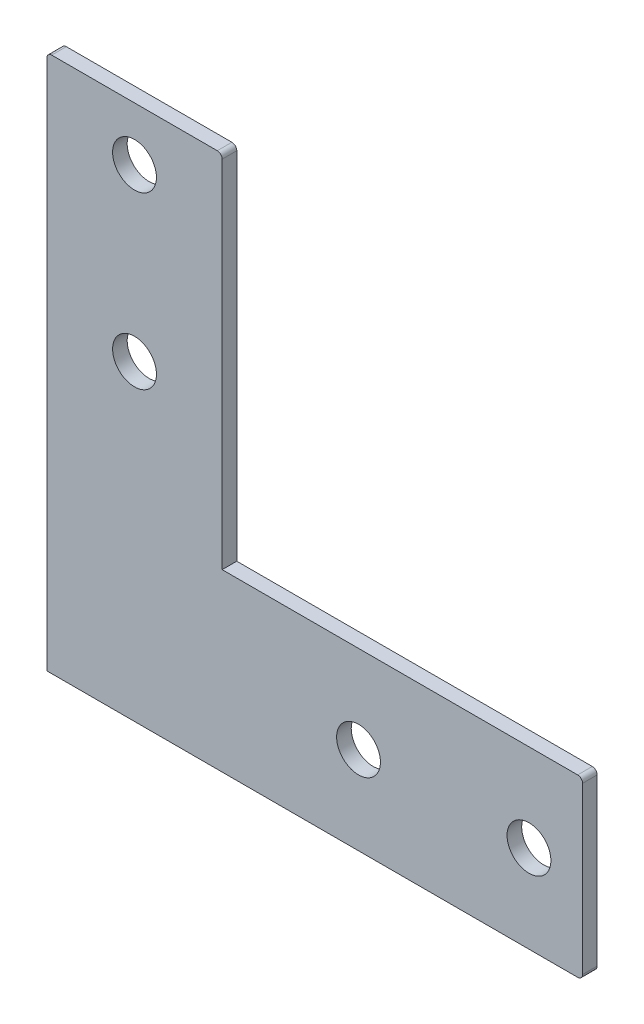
ISO-10303-21;
HEADER;
FILE_DESCRIPTION(('STEP AP214'),'2;1');
FILE_NAME('part.step','',(''),(''),'','','');
FILE_SCHEMA(('AUTOMOTIVE_DESIGN { 1 0 10303 214 1 1 1 1 }'));
ENDSEC;
DATA;
#1=APPLICATION_CONTEXT('core data for automotive mechanical design processes');
#2=APPLICATION_PROTOCOL_DEFINITION('international standard','automotive_design',2000,#1);
#3=PRODUCT_CONTEXT('',#1,'mechanical');
#4=PRODUCT('Part','Part','',(#3));
#5=PRODUCT_RELATED_PRODUCT_CATEGORY('part','',(#4));
#6=PRODUCT_DEFINITION_FORMATION('','',#4);
#7=PRODUCT_DEFINITION_CONTEXT('part definition',#1,'design');
#8=PRODUCT_DEFINITION('design','',#6,#7);
#9=PRODUCT_DEFINITION_SHAPE('','',#8);
#10=(LENGTH_UNIT() NAMED_UNIT(*) SI_UNIT(.MILLI.,.METRE.));
#11=(NAMED_UNIT(*) PLANE_ANGLE_UNIT() SI_UNIT($,.RADIAN.));
#12=(NAMED_UNIT(*) SI_UNIT($,.STERADIAN.) SOLID_ANGLE_UNIT());
#13=UNCERTAINTY_MEASURE_WITH_UNIT(LENGTH_MEASURE(1.E-05),#10,'distance_accuracy_value','');
#14=(GEOMETRIC_REPRESENTATION_CONTEXT(3) GLOBAL_UNCERTAINTY_ASSIGNED_CONTEXT((#13)) GLOBAL_UNIT_ASSIGNED_CONTEXT((#10,
#11,#12)) REPRESENTATION_CONTEXT('',''));
#15=CARTESIAN_POINT('',(0.,0.,0.));
#16=DIRECTION('',(0.,0.,1.));
#17=DIRECTION('',(1.,0.,0.));
#18=AXIS2_PLACEMENT_3D('',#15,#16,#17);
#19=CARTESIAN_POINT('',(0.,0.,1.5));
#20=DIRECTION('',(0.,0.,-1.));
#21=DIRECTION('',(-1.,0.,0.));
#22=AXIS2_PLACEMENT_3D('',#19,#20,#21);
#23=PLANE('',#22);
#24=CARTESIAN_POINT('',(99.,18.,1.5));
#25=DIRECTION('',(0.,0.,1.));
#26=DIRECTION('',(-1.,0.,0.));
#27=AXIS2_PLACEMENT_3D('',#24,#25,#26);
#28=CIRCLE('',#27,4.50000000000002);
#29=CARTESIAN_POINT('',(94.5,18.,1.5));
#30=VERTEX_POINT('',#29);
#31=EDGE_CURVE('E229',#30,#30,#28,.T.);
#32=ORIENTED_EDGE('',*,*,#31,.F.);
#33=EDGE_LOOP('',(#32));
#34=FACE_BOUND('',#33,.T.);
#35=CARTESIAN_POINT('',(18.,99.,1.5));
#36=DIRECTION('',(0.,0.,1.));
#37=DIRECTION('',(1.,0.,0.));
#38=AXIS2_PLACEMENT_3D('',#35,#36,#37);
#39=CIRCLE('',#38,4.50000000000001);
#40=CARTESIAN_POINT('',(22.5,99.,1.5));
#41=VERTEX_POINT('',#40);
#42=EDGE_CURVE('E149',#41,#41,#39,.T.);
#43=ORIENTED_EDGE('',*,*,#42,.F.);
#44=EDGE_LOOP('',(#43));
#45=FACE_BOUND('',#44,.T.);
#46=DIRECTION('',(1.,0.,0.));
#47=VECTOR('',#46,1.);
#48=CARTESIAN_POINT('',(110.,0.,1.5));
#49=LINE('',#48,#47);
#50=CARTESIAN_POINT('',(0.,0.,1.5));
#51=VERTEX_POINT('',#50);
#52=CARTESIAN_POINT('',(109.,0.,1.5));
#53=VERTEX_POINT('',#52);
#54=EDGE_CURVE('E159',#51,#53,#49,.T.);
#55=ORIENTED_EDGE('',*,*,#54,.T.);
#56=CARTESIAN_POINT('',(109.,1.00000000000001,1.5));
#57=DIRECTION('',(0.,0.,-1.));
#58=DIRECTION('',(-1.,0.,0.));
#59=AXIS2_PLACEMENT_3D('',#56,#57,#58);
#60=CIRCLE('',#59,1.);
#61=CARTESIAN_POINT('',(110.,1.00000000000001,1.5));
#62=VERTEX_POINT('',#61);
#63=EDGE_CURVE('E180',#53,#62,#60,.F.);
#64=ORIENTED_EDGE('',*,*,#63,.T.);
#65=DIRECTION('',(0.,1.,0.));
#66=VECTOR('',#65,1.);
#67=CARTESIAN_POINT('',(110.,36.,1.5));
#68=LINE('',#67,#66);
#69=CARTESIAN_POINT('',(110.,35.,1.5));
#70=VERTEX_POINT('',#69);
#71=EDGE_CURVE('E123',#62,#70,#68,.T.);
#72=ORIENTED_EDGE('',*,*,#71,.T.);
#73=CARTESIAN_POINT('',(109.,35.,1.5));
#74=DIRECTION('',(0.,0.,-1.));
#75=DIRECTION('',(-1.,0.,0.));
#76=AXIS2_PLACEMENT_3D('',#73,#74,#75);
#77=CIRCLE('',#76,1.);
#78=CARTESIAN_POINT('',(109.,36.,1.5));
#79=VERTEX_POINT('',#78);
#80=EDGE_CURVE('E119',#70,#79,#77,.F.);
#81=ORIENTED_EDGE('',*,*,#80,.T.);
#82=DIRECTION('',(-1.,0.,0.));
#83=VECTOR('',#82,1.);
#84=CARTESIAN_POINT('',(36.,36.,1.5));
#85=LINE('',#84,#83);
#86=CARTESIAN_POINT('',(36.,36.,1.5));
#87=VERTEX_POINT('',#86);
#88=EDGE_CURVE('E110',#79,#87,#85,.T.);
#89=ORIENTED_EDGE('',*,*,#88,.T.);
#90=DIRECTION('',(0.,1.,0.));
#91=VECTOR('',#90,1.);
#92=CARTESIAN_POINT('',(36.,110.,1.5));
#93=LINE('',#92,#91);
#94=CARTESIAN_POINT('',(36.,109.,1.5));
#95=VERTEX_POINT('',#94);
#96=EDGE_CURVE('E115',#87,#95,#93,.T.);
#97=ORIENTED_EDGE('',*,*,#96,.T.);
#98=CARTESIAN_POINT('',(35.,109.,1.5));
#99=DIRECTION('',(0.,0.,-1.));
#100=DIRECTION('',(-1.,0.,0.));
#101=AXIS2_PLACEMENT_3D('',#98,#99,#100);
#102=CIRCLE('',#101,1.);
#103=CARTESIAN_POINT('',(35.,110.,1.5));
#104=VERTEX_POINT('',#103);
#105=EDGE_CURVE('E176',#95,#104,#102,.F.);
#106=ORIENTED_EDGE('',*,*,#105,.T.);
#107=DIRECTION('',(-1.,0.,0.));
#108=VECTOR('',#107,1.);
#109=CARTESIAN_POINT('',(0.,110.,1.5));
#110=LINE('',#109,#108);
#111=CARTESIAN_POINT('',(1.,110.,1.5));
#112=VERTEX_POINT('',#111);
#113=EDGE_CURVE('E138',#104,#112,#110,.T.);
#114=ORIENTED_EDGE('',*,*,#113,.T.);
#115=CARTESIAN_POINT('',(1.,109.,1.5));
#116=DIRECTION('',(0.,0.,-1.));
#117=DIRECTION('',(-1.,0.,0.));
#118=AXIS2_PLACEMENT_3D('',#115,#116,#117);
#119=CIRCLE('',#118,1.);
#120=CARTESIAN_POINT('',(0.,109.,1.5));
#121=VERTEX_POINT('',#120);
#122=EDGE_CURVE('E49',#112,#121,#119,.F.);
#123=ORIENTED_EDGE('',*,*,#122,.T.);
#124=DIRECTION('',(0.,-1.,0.));
#125=VECTOR('',#124,1.);
#126=CARTESIAN_POINT('',(0.,0.,1.5));
#127=LINE('',#126,#125);
#128=EDGE_CURVE('E140',#121,#51,#127,.T.);
#129=ORIENTED_EDGE('',*,*,#128,.T.);
#130=EDGE_LOOP('',(#55,#64,#72,#81,#89,#97,#106,#114,#123,#129));
#131=FACE_BOUND('',#130,.T.);
#132=CARTESIAN_POINT('',(18.,64.,1.5));
#133=DIRECTION('',(0.,0.,1.));
#134=DIRECTION('',(1.,0.,0.));
#135=AXIS2_PLACEMENT_3D('',#132,#133,#134);
#136=CIRCLE('',#135,4.5);
#137=CARTESIAN_POINT('',(22.5,64.,1.5));
#138=VERTEX_POINT('',#137);
#139=EDGE_CURVE('E223',#138,#138,#136,.T.);
#140=ORIENTED_EDGE('',*,*,#139,.F.);
#141=EDGE_LOOP('',(#140));
#142=FACE_BOUND('',#141,.T.);
#143=CARTESIAN_POINT('',(64.,18.,1.5));
#144=DIRECTION('',(0.,0.,1.));
#145=DIRECTION('',(-1.,0.,0.));
#146=AXIS2_PLACEMENT_3D('',#143,#144,#145);
#147=CIRCLE('',#146,4.49999999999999);
#148=CARTESIAN_POINT('',(59.5,18.,1.5));
#149=VERTEX_POINT('',#148);
#150=EDGE_CURVE('E235',#149,#149,#147,.T.);
#151=ORIENTED_EDGE('',*,*,#150,.F.);
#152=EDGE_LOOP('',(#151));
#153=FACE_BOUND('',#152,.T.);
#154=ADVANCED_FACE('F34',(#34,#45,#131,#142,#153),#23,.F.);
#155=CARTESIAN_POINT('',(0.,0.,-1.5));
#156=DIRECTION('',(0.,0.,-1.));
#157=DIRECTION('',(-1.,0.,0.));
#158=AXIS2_PLACEMENT_3D('',#155,#156,#157);
#159=PLANE('',#158);
#160=CARTESIAN_POINT('',(99.,18.,-1.5));
#161=DIRECTION('',(0.,0.,1.));
#162=DIRECTION('',(-1.,0.,0.));
#163=AXIS2_PLACEMENT_3D('',#160,#161,#162);
#164=CIRCLE('',#163,4.50000000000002);
#165=CARTESIAN_POINT('',(94.5,18.,-1.5));
#166=VERTEX_POINT('',#165);
#167=EDGE_CURVE('E232',#166,#166,#164,.T.);
#168=ORIENTED_EDGE('',*,*,#167,.T.);
#169=EDGE_LOOP('',(#168));
#170=FACE_BOUND('',#169,.T.);
#171=CARTESIAN_POINT('',(18.,99.,-1.5));
#172=DIRECTION('',(0.,0.,1.));
#173=DIRECTION('',(1.,0.,0.));
#174=AXIS2_PLACEMENT_3D('',#171,#172,#173);
#175=CIRCLE('',#174,4.50000000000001);
#176=CARTESIAN_POINT('',(22.5,99.,-1.5));
#177=VERTEX_POINT('',#176);
#178=EDGE_CURVE('E220',#177,#177,#175,.T.);
#179=ORIENTED_EDGE('',*,*,#178,.T.);
#180=EDGE_LOOP('',(#179));
#181=FACE_BOUND('',#180,.T.);
#182=DIRECTION('',(0.,1.,0.));
#183=VECTOR('',#182,1.);
#184=CARTESIAN_POINT('',(110.,36.,-1.5));
#185=LINE('',#184,#183);
#186=CARTESIAN_POINT('',(110.,1.00000000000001,-1.5));
#187=VERTEX_POINT('',#186);
#188=CARTESIAN_POINT('',(110.,35.,-1.5));
#189=VERTEX_POINT('',#188);
#190=EDGE_CURVE('E148',#187,#189,#185,.T.);
#191=ORIENTED_EDGE('',*,*,#190,.F.);
#192=CARTESIAN_POINT('',(109.,1.00000000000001,-1.5));
#193=DIRECTION('',(0.,0.,-1.));
#194=DIRECTION('',(-1.,0.,0.));
#195=AXIS2_PLACEMENT_3D('',#192,#193,#194);
#196=CIRCLE('',#195,1.);
#197=CARTESIAN_POINT('',(109.,0.,-1.5));
#198=VERTEX_POINT('',#197);
#199=EDGE_CURVE('E172',#187,#198,#196,.T.);
#200=ORIENTED_EDGE('',*,*,#199,.T.);
#201=DIRECTION('',(1.,0.,0.));
#202=VECTOR('',#201,1.);
#203=CARTESIAN_POINT('',(110.,0.,-1.5));
#204=LINE('',#203,#202);
#205=CARTESIAN_POINT('',(0.,0.,-1.5));
#206=VERTEX_POINT('',#205);
#207=EDGE_CURVE('E145',#206,#198,#204,.T.);
#208=ORIENTED_EDGE('',*,*,#207,.F.);
#209=DIRECTION('',(0.,-1.,0.));
#210=VECTOR('',#209,1.);
#211=CARTESIAN_POINT('',(0.,0.,-1.5));
#212=LINE('',#211,#210);
#213=CARTESIAN_POINT('',(0.,109.,-1.5));
#214=VERTEX_POINT('',#213);
#215=EDGE_CURVE('E157',#214,#206,#212,.T.);
#216=ORIENTED_EDGE('',*,*,#215,.F.);
#217=CARTESIAN_POINT('',(1.,109.,-1.5));
#218=DIRECTION('',(0.,0.,-1.));
#219=DIRECTION('',(-1.,0.,0.));
#220=AXIS2_PLACEMENT_3D('',#217,#218,#219);
#221=CIRCLE('',#220,1.);
#222=CARTESIAN_POINT('',(1.,110.,-1.5));
#223=VERTEX_POINT('',#222);
#224=EDGE_CURVE('E168',#214,#223,#221,.T.);
#225=ORIENTED_EDGE('',*,*,#224,.T.);
#226=DIRECTION('',(-1.,0.,0.));
#227=VECTOR('',#226,1.);
#228=CARTESIAN_POINT('',(0.,110.,-1.5));
#229=LINE('',#228,#227);
#230=CARTESIAN_POINT('',(35.,110.,-1.5));
#231=VERTEX_POINT('',#230);
#232=EDGE_CURVE('E155',#231,#223,#229,.T.);
#233=ORIENTED_EDGE('',*,*,#232,.F.);
#234=CARTESIAN_POINT('',(35.,109.,-1.5));
#235=DIRECTION('',(0.,0.,-1.));
#236=DIRECTION('',(-1.,0.,0.));
#237=AXIS2_PLACEMENT_3D('',#234,#235,#236);
#238=CIRCLE('',#237,1.);
#239=CARTESIAN_POINT('',(36.,109.,-1.5));
#240=VERTEX_POINT('',#239);
#241=EDGE_CURVE('E166',#231,#240,#238,.T.);
#242=ORIENTED_EDGE('',*,*,#241,.T.);
#243=DIRECTION('',(0.,1.,0.));
#244=VECTOR('',#243,1.);
#245=CARTESIAN_POINT('',(36.,110.,-1.5));
#246=LINE('',#245,#244);
#247=CARTESIAN_POINT('',(36.,36.,-1.5));
#248=VERTEX_POINT('',#247);
#249=EDGE_CURVE('E153',#248,#240,#246,.T.);
#250=ORIENTED_EDGE('',*,*,#249,.F.);
#251=DIRECTION('',(-1.,0.,0.));
#252=VECTOR('',#251,1.);
#253=CARTESIAN_POINT('',(36.,36.,-1.5));
#254=LINE('',#253,#252);
#255=CARTESIAN_POINT('',(109.,36.,-1.5));
#256=VERTEX_POINT('',#255);
#257=EDGE_CURVE('E129',#256,#248,#254,.T.);
#258=ORIENTED_EDGE('',*,*,#257,.F.);
#259=CARTESIAN_POINT('',(109.,35.,-1.5));
#260=DIRECTION('',(0.,0.,-1.));
#261=DIRECTION('',(-1.,0.,0.));
#262=AXIS2_PLACEMENT_3D('',#259,#260,#261);
#263=CIRCLE('',#262,1.);
#264=EDGE_CURVE('E170',#256,#189,#263,.T.);
#265=ORIENTED_EDGE('',*,*,#264,.T.);
#266=EDGE_LOOP('',(#191,#200,#208,#216,#225,#233,#242,#250,#258,#265));
#267=FACE_BOUND('',#266,.T.);
#268=CARTESIAN_POINT('',(18.,64.,-1.5));
#269=DIRECTION('',(0.,0.,1.));
#270=DIRECTION('',(1.,0.,0.));
#271=AXIS2_PLACEMENT_3D('',#268,#269,#270);
#272=CIRCLE('',#271,4.5);
#273=CARTESIAN_POINT('',(22.5,64.,-1.5));
#274=VERTEX_POINT('',#273);
#275=EDGE_CURVE('E226',#274,#274,#272,.T.);
#276=ORIENTED_EDGE('',*,*,#275,.T.);
#277=EDGE_LOOP('',(#276));
#278=FACE_BOUND('',#277,.T.);
#279=CARTESIAN_POINT('',(64.,18.,-1.5));
#280=DIRECTION('',(0.,0.,1.));
#281=DIRECTION('',(-1.,0.,0.));
#282=AXIS2_PLACEMENT_3D('',#279,#280,#281);
#283=CIRCLE('',#282,4.49999999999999);
#284=CARTESIAN_POINT('',(59.5,18.,-1.5));
#285=VERTEX_POINT('',#284);
#286=EDGE_CURVE('E238',#285,#285,#283,.T.);
#287=ORIENTED_EDGE('',*,*,#286,.T.);
#288=EDGE_LOOP('',(#287));
#289=FACE_BOUND('',#288,.T.);
#290=ADVANCED_FACE('F195',(#170,#181,#267,#278,#289),#159,.T.);
#291=CARTESIAN_POINT('',(110.,0.,1.5));
#292=DIRECTION('',(0.,1.,0.));
#293=DIRECTION('',(-1.,0.,0.));
#294=AXIS2_PLACEMENT_3D('',#291,#292,#293);
#295=PLANE('',#294);
#296=ORIENTED_EDGE('',*,*,#207,.T.);
#297=DIRECTION('',(0.,0.,-1.));
#298=VECTOR('',#297,1.);
#299=CARTESIAN_POINT('',(109.,0.,1.5));
#300=LINE('',#299,#298);
#301=EDGE_CURVE('E174',#198,#53,#300,.F.);
#302=ORIENTED_EDGE('',*,*,#301,.T.);
#303=ORIENTED_EDGE('',*,*,#54,.F.);
#304=DIRECTION('',(0.,0.,-1.));
#305=VECTOR('',#304,1.);
#306=CARTESIAN_POINT('',(0.,0.,1.5));
#307=LINE('',#306,#305);
#308=EDGE_CURVE('E134',#51,#206,#307,.T.);
#309=ORIENTED_EDGE('',*,*,#308,.T.);
#310=EDGE_LOOP('',(#296,#302,#303,#309));
#311=FACE_BOUND('',#310,.T.);
#312=ADVANCED_FACE('F254',(#311),#295,.F.);
#313=CARTESIAN_POINT('',(110.,36.,1.5));
#314=DIRECTION('',(-1.,0.,0.));
#315=DIRECTION('',(0.,0.,1.));
#316=AXIS2_PLACEMENT_3D('',#313,#314,#315);
#317=PLANE('',#316);
#318=ORIENTED_EDGE('',*,*,#71,.F.);
#319=DIRECTION('',(0.,0.,-1.));
#320=VECTOR('',#319,1.);
#321=CARTESIAN_POINT('',(110.,1.00000000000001,1.5));
#322=LINE('',#321,#320);
#323=EDGE_CURVE('E163',#62,#187,#322,.T.);
#324=ORIENTED_EDGE('',*,*,#323,.T.);
#325=ORIENTED_EDGE('',*,*,#190,.T.);
#326=DIRECTION('',(0.,0.,-1.));
#327=VECTOR('',#326,1.);
#328=CARTESIAN_POINT('',(110.,35.,1.5));
#329=LINE('',#328,#327);
#330=EDGE_CURVE('E133',#189,#70,#329,.F.);
#331=ORIENTED_EDGE('',*,*,#330,.T.);
#332=EDGE_LOOP('',(#318,#324,#325,#331));
#333=FACE_BOUND('',#332,.T.);
#334=ADVANCED_FACE('F215',(#333),#317,.F.);
#335=CARTESIAN_POINT('',(36.,36.,1.5));
#336=DIRECTION('',(0.,-1.,0.));
#337=DIRECTION('',(0.,0.,-1.));
#338=AXIS2_PLACEMENT_3D('',#335,#336,#337);
#339=PLANE('',#338);
#340=ORIENTED_EDGE('',*,*,#88,.F.);
#341=DIRECTION('',(0.,0.,-1.));
#342=VECTOR('',#341,1.);
#343=CARTESIAN_POINT('',(109.,36.,1.5));
#344=LINE('',#343,#342);
#345=EDGE_CURVE('E182',#79,#256,#344,.T.);
#346=ORIENTED_EDGE('',*,*,#345,.T.);
#347=ORIENTED_EDGE('',*,*,#257,.T.);
#348=DIRECTION('',(0.,0.,-1.));
#349=VECTOR('',#348,1.);
#350=CARTESIAN_POINT('',(36.,36.,1.5));
#351=LINE('',#350,#349);
#352=EDGE_CURVE('E126',#87,#248,#351,.T.);
#353=ORIENTED_EDGE('',*,*,#352,.F.);
#354=EDGE_LOOP('',(#340,#346,#347,#353));
#355=FACE_BOUND('',#354,.T.);
#356=ADVANCED_FACE('F127',(#355),#339,.F.);
#357=CARTESIAN_POINT('',(36.,110.,1.5));
#358=DIRECTION('',(-1.,0.,0.));
#359=DIRECTION('',(0.,-1.,0.));
#360=AXIS2_PLACEMENT_3D('',#357,#358,#359);
#361=PLANE('',#360);
#362=ORIENTED_EDGE('',*,*,#249,.T.);
#363=DIRECTION('',(0.,0.,-1.));
#364=VECTOR('',#363,1.);
#365=CARTESIAN_POINT('',(36.,109.,1.5));
#366=LINE('',#365,#364);
#367=EDGE_CURVE('E11',#240,#95,#366,.F.);
#368=ORIENTED_EDGE('',*,*,#367,.T.);
#369=ORIENTED_EDGE('',*,*,#96,.F.);
#370=ORIENTED_EDGE('',*,*,#352,.T.);
#371=EDGE_LOOP('',(#362,#368,#369,#370));
#372=FACE_BOUND('',#371,.T.);
#373=ADVANCED_FACE('F136',(#372),#361,.F.);
#374=CARTESIAN_POINT('',(0.,110.,1.5));
#375=DIRECTION('',(0.,-1.,0.));
#376=DIRECTION('',(0.,0.,-1.));
#377=AXIS2_PLACEMENT_3D('',#374,#375,#376);
#378=PLANE('',#377);
#379=ORIENTED_EDGE('',*,*,#232,.T.);
#380=DIRECTION('',(0.,0.,-1.));
#381=VECTOR('',#380,1.);
#382=CARTESIAN_POINT('',(1.,110.,1.5));
#383=LINE('',#382,#381);
#384=EDGE_CURVE('E42',#223,#112,#383,.F.);
#385=ORIENTED_EDGE('',*,*,#384,.T.);
#386=ORIENTED_EDGE('',*,*,#113,.F.);
#387=DIRECTION('',(0.,0.,-1.));
#388=VECTOR('',#387,1.);
#389=CARTESIAN_POINT('',(35.,110.,1.5));
#390=LINE('',#389,#388);
#391=EDGE_CURVE('E187',#104,#231,#390,.T.);
#392=ORIENTED_EDGE('',*,*,#391,.T.);
#393=EDGE_LOOP('',(#379,#385,#386,#392));
#394=FACE_BOUND('',#393,.T.);
#395=ADVANCED_FACE('F191',(#394),#378,.F.);
#396=CARTESIAN_POINT('',(0.,0.,1.5));
#397=DIRECTION('',(1.,0.,0.));
#398=DIRECTION('',(0.,0.,-1.));
#399=AXIS2_PLACEMENT_3D('',#396,#397,#398);
#400=PLANE('',#399);
#401=ORIENTED_EDGE('',*,*,#128,.F.);
#402=DIRECTION('',(0.,0.,-1.));
#403=VECTOR('',#402,1.);
#404=CARTESIAN_POINT('',(0.,109.,1.5));
#405=LINE('',#404,#403);
#406=EDGE_CURVE('E184',#121,#214,#405,.T.);
#407=ORIENTED_EDGE('',*,*,#406,.T.);
#408=ORIENTED_EDGE('',*,*,#215,.T.);
#409=ORIENTED_EDGE('',*,*,#308,.F.);
#410=EDGE_LOOP('',(#401,#407,#408,#409));
#411=FACE_BOUND('',#410,.T.);
#412=ADVANCED_FACE('F203',(#411),#400,.F.);
#413=CARTESIAN_POINT('',(18.,99.,1.5));
#414=DIRECTION('',(0.,0.,-1.));
#415=DIRECTION('',(-1.,0.,0.));
#416=AXIS2_PLACEMENT_3D('',#413,#414,#415);
#417=CYLINDRICAL_SURFACE('',#416,4.50000000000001);
#418=ORIENTED_EDGE('',*,*,#42,.T.);
#419=EDGE_LOOP('',(#418));
#420=FACE_BOUND('',#419,.T.);
#421=ORIENTED_EDGE('',*,*,#178,.F.);
#422=EDGE_LOOP('',(#421));
#423=FACE_BOUND('',#422,.T.);
#424=ADVANCED_FACE('F260',(#420,#423),#417,.F.);
#425=CARTESIAN_POINT('',(18.,64.,1.5));
#426=DIRECTION('',(0.,0.,-1.));
#427=DIRECTION('',(-1.,0.,0.));
#428=AXIS2_PLACEMENT_3D('',#425,#426,#427);
#429=CYLINDRICAL_SURFACE('',#428,4.5);
#430=ORIENTED_EDGE('',*,*,#139,.T.);
#431=EDGE_LOOP('',(#430));
#432=FACE_BOUND('',#431,.T.);
#433=ORIENTED_EDGE('',*,*,#275,.F.);
#434=EDGE_LOOP('',(#433));
#435=FACE_BOUND('',#434,.T.);
#436=ADVANCED_FACE('F358',(#432,#435),#429,.F.);
#437=CARTESIAN_POINT('',(99.,18.,1.5));
#438=DIRECTION('',(0.,0.,-1.));
#439=DIRECTION('',(-1.,0.,0.));
#440=AXIS2_PLACEMENT_3D('',#437,#438,#439);
#441=CYLINDRICAL_SURFACE('',#440,4.50000000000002);
#442=ORIENTED_EDGE('',*,*,#31,.T.);
#443=EDGE_LOOP('',(#442));
#444=FACE_BOUND('',#443,.T.);
#445=ORIENTED_EDGE('',*,*,#167,.F.);
#446=EDGE_LOOP('',(#445));
#447=FACE_BOUND('',#446,.T.);
#448=ADVANCED_FACE('F366',(#444,#447),#441,.F.);
#449=CARTESIAN_POINT('',(64.,18.,1.5));
#450=DIRECTION('',(0.,0.,-1.));
#451=DIRECTION('',(-1.,0.,0.));
#452=AXIS2_PLACEMENT_3D('',#449,#450,#451);
#453=CYLINDRICAL_SURFACE('',#452,4.49999999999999);
#454=ORIENTED_EDGE('',*,*,#150,.T.);
#455=EDGE_LOOP('',(#454));
#456=FACE_BOUND('',#455,.T.);
#457=ORIENTED_EDGE('',*,*,#286,.F.);
#458=EDGE_LOOP('',(#457));
#459=FACE_BOUND('',#458,.T.);
#460=ADVANCED_FACE('F244',(#456,#459),#453,.F.);
#461=CARTESIAN_POINT('',(109.,1.00000000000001,1.5));
#462=DIRECTION('',(0.,0.,-1.));
#463=DIRECTION('',(-1.,0.,0.));
#464=AXIS2_PLACEMENT_3D('',#461,#462,#463);
#465=CYLINDRICAL_SURFACE('',#464,1.);
#466=ORIENTED_EDGE('',*,*,#63,.F.);
#467=ORIENTED_EDGE('',*,*,#301,.F.);
#468=ORIENTED_EDGE('',*,*,#199,.F.);
#469=ORIENTED_EDGE('',*,*,#323,.F.);
#470=EDGE_LOOP('',(#466,#467,#468,#469));
#471=FACE_BOUND('',#470,.T.);
#472=ADVANCED_FACE('F213',(#471),#465,.T.);
#473=CARTESIAN_POINT('',(109.,35.,1.5));
#474=DIRECTION('',(0.,0.,-1.));
#475=DIRECTION('',(-1.,0.,0.));
#476=AXIS2_PLACEMENT_3D('',#473,#474,#475);
#477=CYLINDRICAL_SURFACE('',#476,1.);
#478=ORIENTED_EDGE('',*,*,#80,.F.);
#479=ORIENTED_EDGE('',*,*,#330,.F.);
#480=ORIENTED_EDGE('',*,*,#264,.F.);
#481=ORIENTED_EDGE('',*,*,#345,.F.);
#482=EDGE_LOOP('',(#478,#479,#480,#481));
#483=FACE_BOUND('',#482,.T.);
#484=ADVANCED_FACE('F218',(#483),#477,.T.);
#485=CARTESIAN_POINT('',(1.,109.,1.5));
#486=DIRECTION('',(0.,0.,-1.));
#487=DIRECTION('',(-1.,0.,0.));
#488=AXIS2_PLACEMENT_3D('',#485,#486,#487);
#489=CYLINDRICAL_SURFACE('',#488,1.);
#490=ORIENTED_EDGE('',*,*,#122,.F.);
#491=ORIENTED_EDGE('',*,*,#384,.F.);
#492=ORIENTED_EDGE('',*,*,#224,.F.);
#493=ORIENTED_EDGE('',*,*,#406,.F.);
#494=EDGE_LOOP('',(#490,#491,#492,#493));
#495=FACE_BOUND('',#494,.T.);
#496=ADVANCED_FACE('F201',(#495),#489,.T.);
#497=CARTESIAN_POINT('',(35.,109.,1.5));
#498=DIRECTION('',(0.,0.,-1.));
#499=DIRECTION('',(-1.,0.,0.));
#500=AXIS2_PLACEMENT_3D('',#497,#498,#499);
#501=CYLINDRICAL_SURFACE('',#500,1.);
#502=ORIENTED_EDGE('',*,*,#105,.F.);
#503=ORIENTED_EDGE('',*,*,#367,.F.);
#504=ORIENTED_EDGE('',*,*,#241,.F.);
#505=ORIENTED_EDGE('',*,*,#391,.F.);
#506=EDGE_LOOP('',(#502,#503,#504,#505));
#507=FACE_BOUND('',#506,.T.);
#508=ADVANCED_FACE('F36',(#507),#501,.T.);
#509=CLOSED_SHELL('',(#154,#290,#312,#334,#356,#373,#395,#412,#424,#436,#448,#460,#472,#484,
#496,#508));
#510=MANIFOLD_SOLID_BREP('B2',#509);
#511=ADVANCED_BREP_SHAPE_REPRESENTATION('',(#18,#510),#14);
#512=SHAPE_DEFINITION_REPRESENTATION(#9,#511);
ENDSEC;
END-ISO-10303-21;
